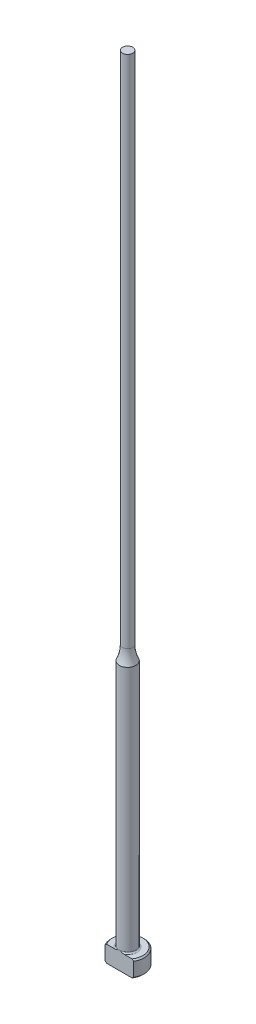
from build123d import *

# Parameters (mm, degrees)
CHAMFER1_SIZE = 0.254
FILLET1_R     = 0.254
KEY_DEPTH     = 153.466131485


with BuildPart() as part:
    # Sketch1 → Revolve1 (revolve)
    with BuildSketch(Plane.XY, mode=Mode.PRIVATE) as revolve1_sk:
        with BuildLine():
            Line((0, 0), (-3.175, 0))
            Line((-3.175, 0), (-3.175, 3.175))
            Line((-3.175, 3.175), (-1.5875, 3.175))
            Line((-1.5875, 3.175), (-1.5875, 50.8))
            ThreePointArc((-1.5875, 50.8), (-1.142565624, 52.109911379), (-0.99187, 53.485093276))
            Line((-0.99187, 53.485093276), (-0.99187, 152.4))
            Line((-0.99187, 152.4), (0, 152.4))
            Line((0, 152.4), (0, 0))
        make_face()
    revolve(revolve1_sk.sketch.rotate(Axis((0, 259.958771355, 0), (0, -1, 0)), 270), axis=Axis((0, 259.958771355, 0), (0, -1, 0)))

    # Chamfer1
    chamfer1_edges = [part.edges().sort_by_distance(p)[0] for p in [
        (0, 0, -3.175),
        (0, 3.175, -3.175),
    ]]
    chamfer(chamfer1_edges, length=CHAMFER1_SIZE)

    # Fillet1
    fillet1_edges = [part.edges().sort_by_distance(p)[0] for p in [
        (0, 3.175, -1.5875),
    ]]
    fillet(fillet1_edges, radius=FILLET1_R)

    # Sketch2 → KEY (cut, through all)
    with BuildSketch(Plane.XZ):
        with BuildLine():
            Line((-2.749630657, 1.5875), (2.749630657, 1.5875))
            ThreePointArc((2.749630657, 1.5875), (0, 3.175), (-2.749630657, 1.5875))
        make_face()
    extrude(amount=-KEY_DEPTH, mode=Mode.SUBTRACT)


solid = part.part
